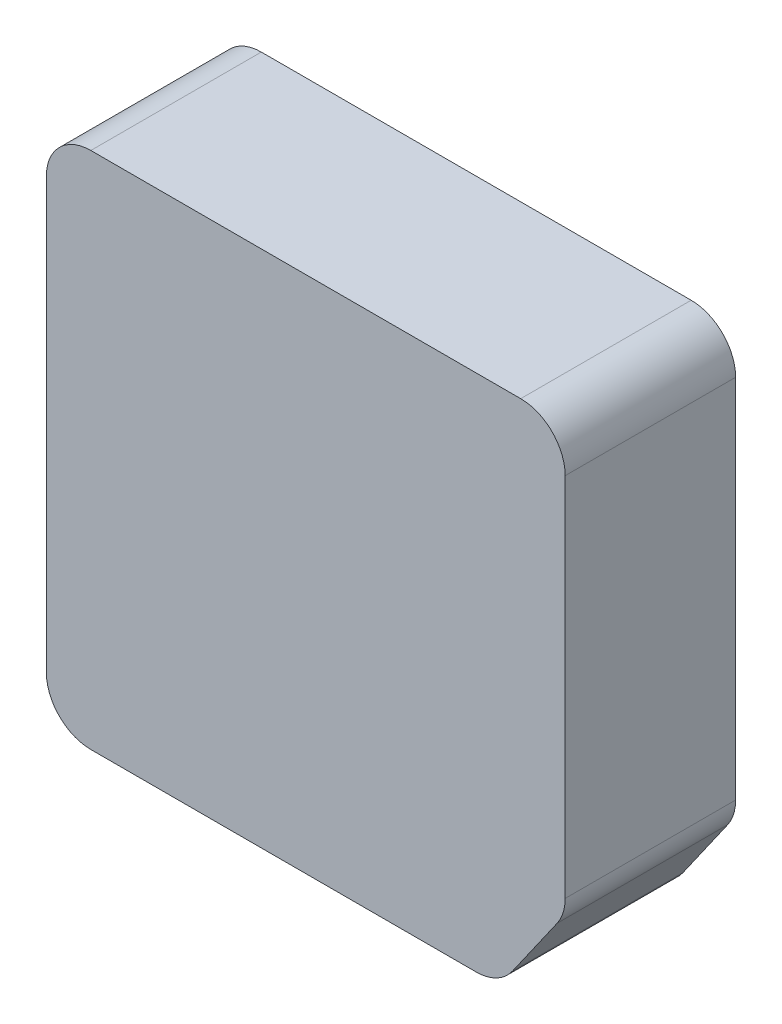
from build123d import *

# Parameters (mm, degrees)
BOSS_EXTRUDE1_DEPTH = 29.21


with BuildPart() as part:
    # Sketch1 → Boss-Extrude1 (new body)
    with BuildSketch(Plane.XY):
        with BuildLine():
            Line((-1027.557, 127.635), (-953.897, 127.635))
            ThreePointArc((-953.897, 127.635), (-948.508846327, 125.403153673), (-946.277, 120.015))
            Line((-946.277, 120.015), (-946.277, 57.278681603))
            ThreePointArc((-946.277, 57.278681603), (-946.629676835, 54.987303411), (-947.655061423, 52.908029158))
            Line((-947.655061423, 52.908029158), (-955.303905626, 41.984347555))
            ThreePointArc((-955.303905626, 41.984347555), (-958.027319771, 39.595977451), (-961.545844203, 38.735))
            Line((-961.545844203, 38.735), (-1027.557, 38.735))
            ThreePointArc((-1027.557, 38.735), (-1032.945153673, 40.966846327), (-1035.177, 46.355))
            Line((-1035.177, 46.355), (-1035.177, 120.015))
            ThreePointArc((-1035.177, 120.015), (-1032.945153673, 125.403153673), (-1027.557, 127.635))
        make_face()
    extrude(amount=-BOSS_EXTRUDE1_DEPTH)


solid = part.part
